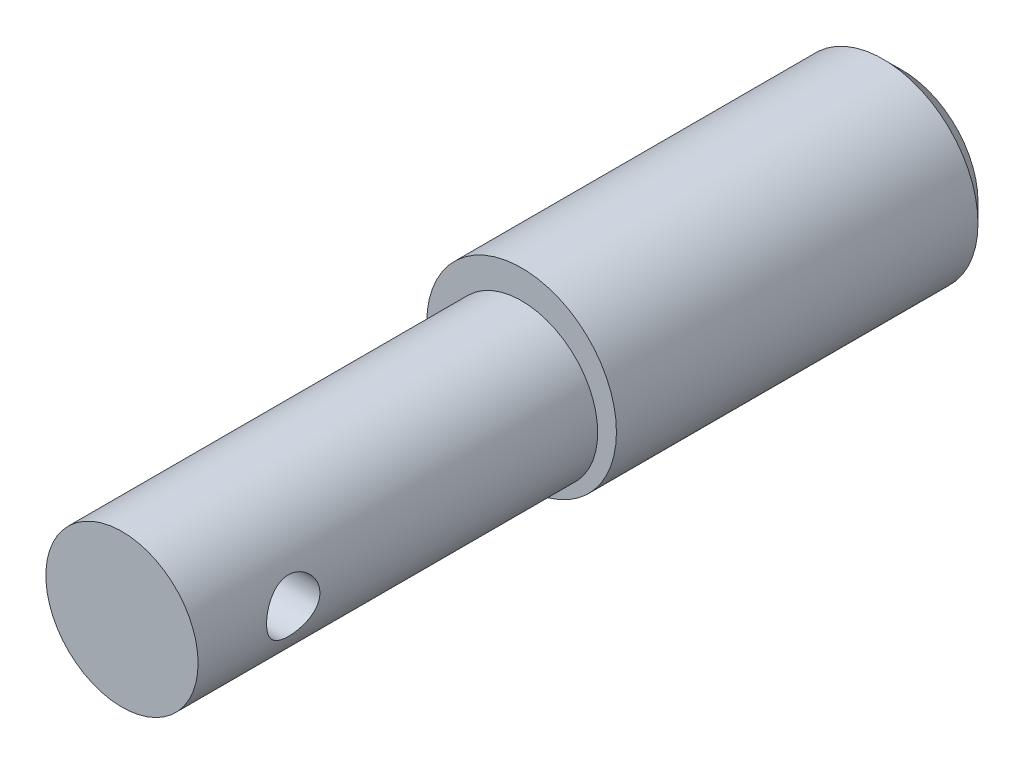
from build123d import *

# Parameters (mm, degrees)
SKETCH1_R                   = 3.95605
BASE_EXTRUDE_DEPTH          = 16.271875
CHAMFER1_SIZE               = 0.79375
SILHOUETTE_W                = 16.66875
SILHOUETTE_H                = 1.18745
LOCKING_PIN_HOLE_DEPTH      = 18.206817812
LOCKING_PIN_HOLE_DEPTH_BACK = 18.206817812
SKETCH5_R                   = 1.112153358


with BuildPart() as part:
    # Sketch1 → Base-Extrude (new, symmetric)
    with BuildSketch(Plane.XY):
        Circle(SKETCH1_R)
    extrude(amount=BASE_EXTRUDE_DEPTH, both=True)

    # Chamfer1
    chamfer1_edges = [part.edges().sort_by_distance(p)[0] for p in [
        (-3.95605, 0, -16.271875),
    ]]
    chamfer(chamfer1_edges, length=CHAMFER1_SIZE)

    # Silhouette → Cut-Revolve1 (revolve, cut)
    with BuildSketch(Plane(origin=(0, 0, 0), x_dir=(0, 0, -1), z_dir=(1, 0, 0)), mode=Mode.PRIVATE) as cut_revolve1_sk:
        with Locations((-7.9375, 3.362325)):
            Rectangle(SILHOUETTE_W, SILHOUETTE_H)
    revolve(cut_revolve1_sk.sketch.rotate(Axis((0, -0.4064, 13.51559633), (0, 0, -1)), 90), axis=Axis((0, -0.4064, 13.51559633), (0, 0, -1)), mode=Mode.SUBTRACT)

    # Sketch5 → Locking pin hole (cut, two sides: drawn at the far end of the back side and taken through both)
    with BuildSketch(Plane(origin=(0, 0, 0), x_dir=(0, 0, -1), z_dir=(1, 0, 0)).offset(-LOCKING_PIN_HOLE_DEPTH_BACK)):
        with Locations((-12.303125, -0.4064)):
            Circle(SKETCH5_R)
    extrude(amount=LOCKING_PIN_HOLE_DEPTH + LOCKING_PIN_HOLE_DEPTH_BACK, mode=Mode.SUBTRACT)


solid = part.part
